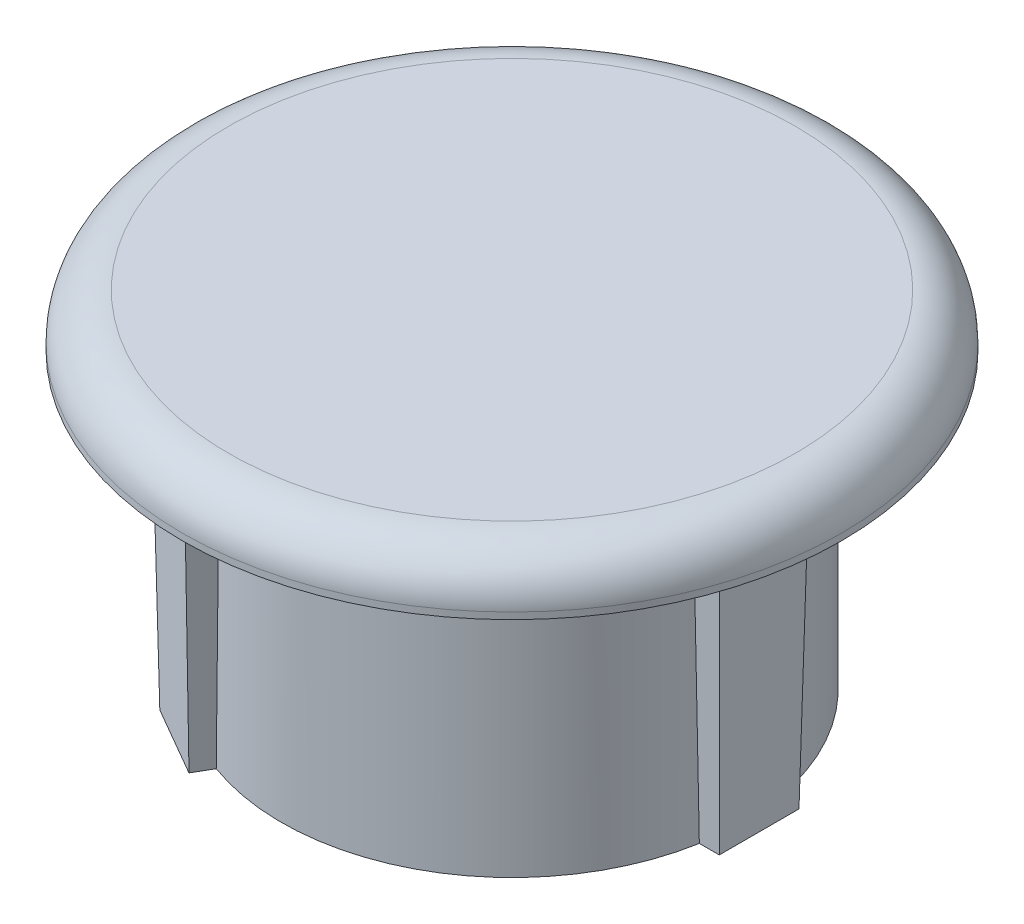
from build123d import *

# Parameters (mm, degrees)
EXTRUSION1_DEPTH           = 4.45
EXTRUSION1_DRAFT           = 1
EXTRUSION1_PROFILE_2_DEPTH = 4.45
EXTRUSION1_PROFILE_2_DRAFT = 1
EXTRUSION1_PROFILE_3_DEPTH = 4.45
EXTRUSION1_PROFILE_3_DRAFT = 1


with BuildPart() as part:
    # Esquisse1 → R_volution1 (revolve)
    with BuildSketch(Plane.XY, mode=Mode.PRIVATE) as r_volution1_sk:
        with BuildLine():
            Line((2.3, 4), (0, 4))
            Line((0, 4), (0, 5.25))
            Line((0, 5.25), (4.3, 5.25))
            ThreePointArc((4.3, 5.25), (4.794974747, 5.044974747), (5, 4.55))
            Line((5, 4.55), (5, 4.45))
            Line((5, 4.45), (3.5, 4.45))
            Line((3.5, 4.45), (3.5, 0))
            Line((3.5, 0), (2.3, 0))
            Line((2.3, 0), (2.3, 4))
        make_face()
    revolve(r_volution1_sk.sketch.rotate(Axis((0, 0, 0), (0, 1, 0)), 90), axis=Axis((0, 0, 0), (0, 1, 0)))


with BuildPart() as extrusion1_tool:
    # Esquisse2 → Extrusion1 (with draft: the straight prism first)
    with BuildSketch(Plane.XZ):
        with BuildLine():
            ThreePointArc((3.447349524, 0.604798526), (3.5, 0), (3.447349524, -0.604798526))
            Line((3.447349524, -0.604798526), (3.75, -0.604798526))
            Line((3.75, -0.604798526), (3.75, 0.604798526))
            Line((3.75, 0.604798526), (3.447349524, 0.604798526))
        make_face()
    extrude(amount=-EXTRUSION1_DEPTH)
    # Extrusion1: the draft: its side faces are tilted about the plane it starts from
    extrusion1_sides = [extrusion1_tool.faces().sort_by_distance(p)[0] for p in [
        (3.598674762, 2.225, -0.604798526),
        (3.75, 2.225, 0),
        (3.598674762, 2.225, 0.604798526),
        (3.5, 2.225, 0),
    ]]
    draft(extrusion1_sides, Plane.XZ, EXTRUSION1_DRAFT)


with BuildPart() as part_1:
    add(part.part)

    # Extrusion1: add extrusion1_tool
    add(extrusion1_tool.part)


with BuildPart() as extrusion1_profile_2_tool:
    # Esquisse2 → Extrusion1 profile 2 (with draft: the straight prism first)
    with BuildSketch(Plane.XZ):
        with BuildLine():
            ThreePointArc((-1.199903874, -3.287891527), (-1.75, -3.031088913), (-2.24744565, -2.683093))
            Line((-2.24744565, -2.683093), (-2.398770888, -2.945196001))
            Line((-2.398770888, -2.945196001), (-1.351229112, -3.549994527))
            Line((-1.351229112, -3.549994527), (-1.199903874, -3.287891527))
        make_face()
    extrude(amount=-EXTRUSION1_PROFILE_2_DEPTH)
    # Extrusion1 profile 2: the draft: its side faces are tilted about the plane it starts from
    extrusion1_profile_2_sides = [extrusion1_profile_2_tool.faces().sort_by_distance(p)[0] for p in [
        (-1.75, 2.225, -3.031088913),
        (-2.323108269, 2.225, -2.814144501),
        (-1.875, 2.225, -3.247595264),
        (-1.275566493, 2.225, -3.418943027),
    ]]
    draft(extrusion1_profile_2_sides, Plane.XZ, EXTRUSION1_PROFILE_2_DRAFT)


with BuildPart() as part_2:
    add(part_1.part)

    # Extrusion1 profile 2: add extrusion1_profile_2_tool
    add(extrusion1_profile_2_tool.part)


with BuildPart() as extrusion1_profile_3_tool:
    # Esquisse2 → Extrusion1 profile 3 (with draft: the straight prism first)
    with BuildSketch(Plane.XZ):
        with BuildLine():
            ThreePointArc((-2.24744565, 2.683093), (-1.75, 3.031088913), (-1.199903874, 3.287891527))
            Line((-1.199903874, 3.287891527), (-1.351229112, 3.549994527))
            Line((-1.351229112, 3.549994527), (-2.398770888, 2.945196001))
            Line((-2.398770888, 2.945196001), (-2.24744565, 2.683093))
        make_face()
    extrude(amount=-EXTRUSION1_PROFILE_3_DEPTH)
    # Extrusion1 profile 3: the draft: its side faces are tilted about the plane it starts from
    extrusion1_profile_3_sides = [extrusion1_profile_3_tool.faces().sort_by_distance(p)[0] for p in [
        (-1.75, 2.225, 3.031088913),
        (-1.275566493, 2.225, 3.418943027),
        (-1.875, 2.225, 3.247595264),
        (-2.323108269, 2.225, 2.814144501),
    ]]
    draft(extrusion1_profile_3_sides, Plane.XZ, EXTRUSION1_PROFILE_3_DRAFT)


with BuildPart() as part_3:
    add(part_2.part)

    # Extrusion1 profile 3: add extrusion1_profile_3_tool
    add(extrusion1_profile_3_tool.part)


solid = part_3.part
